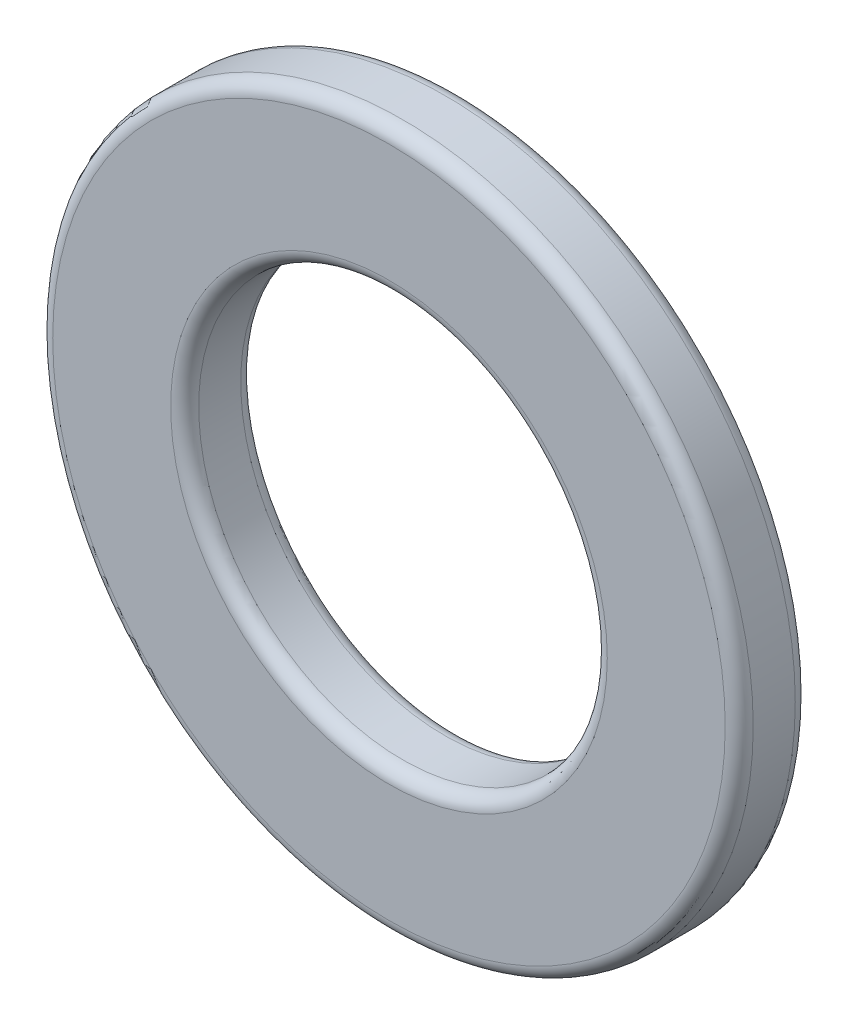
from build123d import *

# Parameters (mm, degrees)
BOSS_EXTRUDE1_DEPTH      = 0.9
BOSS_EXTRUDE1_DEPTH_BACK = 0.9
SKETCH3_R                = 9
SKETCH3_R_2              = 5.25
FILLET1_R                = 0.36


with BuildPart() as part:
    # Sketch3 → Boss-Extrude1 (new, two sides: drawn at the far end of the back side and taken through both)
    with BuildSketch(Plane.XY.offset(-BOSS_EXTRUDE1_DEPTH_BACK)):
        Circle(SKETCH3_R)
        Circle(SKETCH3_R_2, mode=Mode.SUBTRACT)
    extrude(amount=BOSS_EXTRUDE1_DEPTH + BOSS_EXTRUDE1_DEPTH_BACK)

    # Fillet1
    fillet1_edges = [part.edges().sort_by_distance(p)[0] for p in [
        (-9, 0, -0.9),
        (-5.25, 0, -0.9),
        (-9, 0, 0.9),
        (-5.25, 0, 0.9),
    ]]
    fillet(fillet1_edges, radius=FILLET1_R)


solid = part.part
